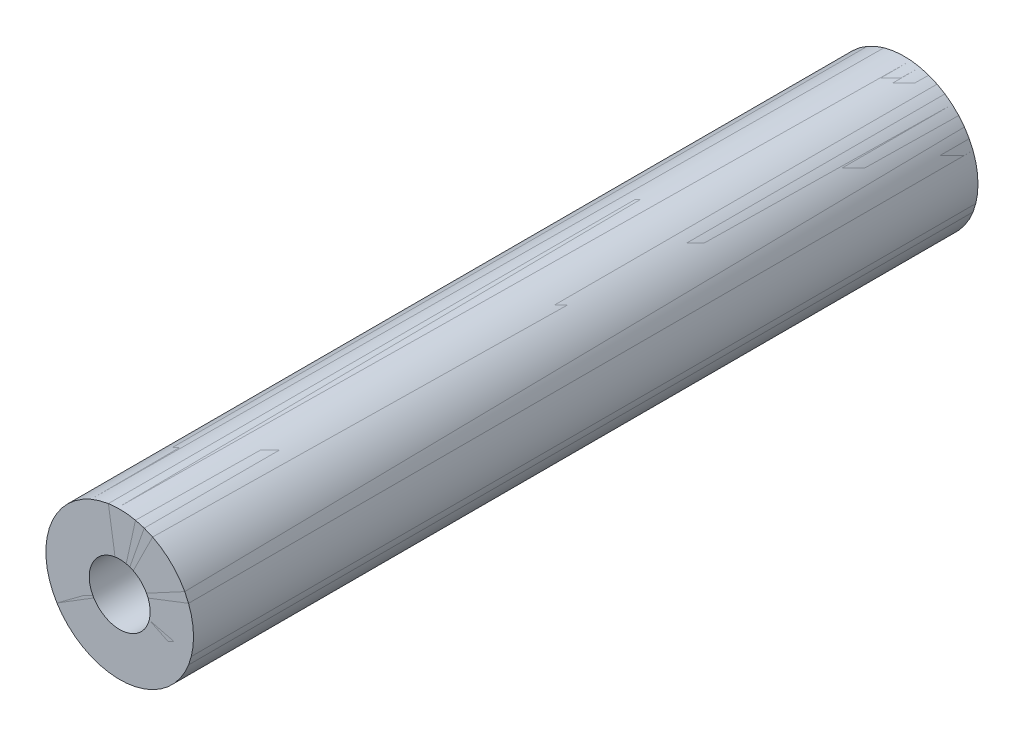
ISO-10303-21;
HEADER;
FILE_DESCRIPTION(('STEP AP214'),'2;1');
FILE_NAME('part.step','',(''),(''),'','','');
FILE_SCHEMA(('AUTOMOTIVE_DESIGN { 1 0 10303 214 1 1 1 1 }'));
ENDSEC;
DATA;
#1=APPLICATION_CONTEXT('core data for automotive mechanical design processes');
#2=APPLICATION_PROTOCOL_DEFINITION('international standard','automotive_design',2000,#1);
#3=PRODUCT_CONTEXT('',#1,'mechanical');
#4=PRODUCT('Part','Part','',(#3));
#5=PRODUCT_RELATED_PRODUCT_CATEGORY('part','',(#4));
#6=PRODUCT_DEFINITION_FORMATION('','',#4);
#7=PRODUCT_DEFINITION_CONTEXT('part definition',#1,'design');
#8=PRODUCT_DEFINITION('design','',#6,#7);
#9=PRODUCT_DEFINITION_SHAPE('','',#8);
#10=(LENGTH_UNIT() NAMED_UNIT(*) SI_UNIT(.MILLI.,.METRE.));
#11=(NAMED_UNIT(*) PLANE_ANGLE_UNIT() SI_UNIT($,.RADIAN.));
#12=(NAMED_UNIT(*) SI_UNIT($,.STERADIAN.) SOLID_ANGLE_UNIT());
#13=UNCERTAINTY_MEASURE_WITH_UNIT(LENGTH_MEASURE(1.E-05),#10,'distance_accuracy_value','');
#14=(GEOMETRIC_REPRESENTATION_CONTEXT(3) GLOBAL_UNCERTAINTY_ASSIGNED_CONTEXT((#13)) GLOBAL_UNIT_ASSIGNED_CONTEXT((#10,
#11,#12)) REPRESENTATION_CONTEXT('',''));
#15=CARTESIAN_POINT('',(0.,0.,0.));
#16=DIRECTION('',(0.,0.,1.));
#17=DIRECTION('',(1.,0.,0.));
#18=AXIS2_PLACEMENT_3D('',#15,#16,#17);
#19=CARTESIAN_POINT('',(-7.01417699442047,-0.607926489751,-55.));
#20=DIRECTION('',(0.,0.,1.));
#21=DIRECTION('',(-1.,0.,0.));
#22=AXIS2_PLACEMENT_3D('',#19,#20,#21);
#23=PLANE('',#22);
#24=CARTESIAN_POINT('',(-11.406250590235,-5.0000000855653,-55.));
#25=DIRECTION('',(0.,0.,1.));
#26=DIRECTION('',(1.,0.,0.));
#27=AXIS2_PLACEMENT_3D('',#24,#25,#26);
#28=CIRCLE('',#27,3.30000000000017);
#29=CARTESIAN_POINT('',(-8.10625059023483,-5.0000000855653,-55.));
#30=VERTEX_POINT('',#29);
#31=EDGE_CURVE('P0_E350',#30,#30,#28,.T.);
#32=ORIENTED_EDGE('',*,*,#31,.F.);
#33=EDGE_LOOP('',(#32));
#34=FACE_BOUND('',#33,.T.);
#35=ADVANCED_FACE('P0_F346',(#34),#23,.F.);
#36=CARTESIAN_POINT('',(-11.406250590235,-5.0000000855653,-85.));
#37=DIRECTION('',(0.,0.,1.));
#38=DIRECTION('',(1.,0.,0.));
#39=AXIS2_PLACEMENT_3D('',#36,#37,#38);
#40=CYLINDRICAL_SURFACE('',#39,3.30000000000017);
#41=ORIENTED_EDGE('',*,*,#31,.T.);
#42=EDGE_LOOP('',(#41));
#43=FACE_BOUND('',#42,.T.);
#44=CARTESIAN_POINT('',(-11.406250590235,-5.0000000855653,-85.));
#45=DIRECTION('',(0.,0.,1.));
#46=DIRECTION('',(1.,0.,0.));
#47=AXIS2_PLACEMENT_3D('',#44,#45,#46);
#48=CIRCLE('',#47,3.30000000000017);
#49=CARTESIAN_POINT('',(-8.10625059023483,-5.0000000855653,-85.));
#50=VERTEX_POINT('',#49);
#51=EDGE_CURVE('P0_E366',#50,#50,#48,.T.);
#52=ORIENTED_EDGE('',*,*,#51,.F.);
#53=EDGE_LOOP('',(#52));
#54=FACE_BOUND('',#53,.T.);
#55=ADVANCED_FACE('P0_F373',(#43,#54),#40,.F.);
#56=CARTESIAN_POINT('',(-21.8430920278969,5.43684135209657,-85.));
#57=DIRECTION('',(0.,0.,-1.));
#58=DIRECTION('',(1.,0.,0.));
#59=AXIS2_PLACEMENT_3D('',#56,#57,#58);
#60=PLANE('',#59);
#61=ORIENTED_EDGE('',*,*,#51,.T.);
#62=EDGE_LOOP('',(#61));
#63=FACE_BOUND('',#62,.T.);
#64=CARTESIAN_POINT('',(-11.406250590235,-5.0000000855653,-85.));
#65=DIRECTION('',(0.,0.,1.));
#66=DIRECTION('',(1.,0.,0.));
#67=AXIS2_PLACEMENT_3D('',#64,#65,#66);
#68=CIRCLE('',#67,8.0000000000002);
#69=CARTESIAN_POINT('',(-3.4062505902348,-5.0000000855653,-85.));
#70=VERTEX_POINT('',#69);
#71=EDGE_CURVE('P0_E364',#70,#70,#68,.F.);
#72=ORIENTED_EDGE('',*,*,#71,.T.);
#73=EDGE_LOOP('',(#72));
#74=FACE_BOUND('',#73,.T.);
#75=ADVANCED_FACE('P0_F381',(#63,#74),#60,.T.);
#76=CARTESIAN_POINT('',(-7.01417699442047,-9.3920736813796,-30.));
#77=DIRECTION('',(0.,0.,-1.));
#78=DIRECTION('',(-1.,0.,0.));
#79=AXIS2_PLACEMENT_3D('',#76,#77,#78);
#80=PLANE('',#79);
#81=CARTESIAN_POINT('',(-11.406250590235,-5.0000000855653,-30.));
#82=DIRECTION('',(0.,0.,1.));
#83=DIRECTION('',(1.,0.,0.));
#84=AXIS2_PLACEMENT_3D('',#81,#82,#83);
#85=CIRCLE('',#84,3.30000000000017);
#86=CARTESIAN_POINT('',(-8.10625059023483,-5.0000000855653,-30.));
#87=VERTEX_POINT('',#86);
#88=EDGE_CURVE('P0_E359',#87,#87,#85,.F.);
#89=ORIENTED_EDGE('',*,*,#88,.F.);
#90=EDGE_LOOP('',(#89));
#91=FACE_BOUND('',#90,.T.);
#92=ADVANCED_FACE('P0_F396',(#91),#80,.F.);
#93=CARTESIAN_POINT('',(-11.406250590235,-5.0000000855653,-85.));
#94=DIRECTION('',(0.,0.,1.));
#95=DIRECTION('',(1.,0.,0.));
#96=AXIS2_PLACEMENT_3D('',#93,#94,#95);
#97=CYLINDRICAL_SURFACE('',#96,8.0000000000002);
#98=ORIENTED_EDGE('',*,*,#71,.F.);
#99=EDGE_LOOP('',(#98));
#100=FACE_BOUND('',#99,.T.);
#101=CARTESIAN_POINT('',(-11.406250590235,-5.0000000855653,0.));
#102=DIRECTION('',(0.,0.,1.));
#103=DIRECTION('',(1.,0.,0.));
#104=AXIS2_PLACEMENT_3D('',#101,#102,#103);
#105=CIRCLE('',#104,8.0000000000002);
#106=CARTESIAN_POINT('',(-3.4062505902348,-5.0000000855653,0.));
#107=VERTEX_POINT('',#106);
#108=EDGE_CURVE('P0_E354',#107,#107,#105,.T.);
#109=ORIENTED_EDGE('',*,*,#108,.F.);
#110=EDGE_LOOP('',(#109));
#111=FACE_BOUND('',#110,.T.);
#112=ADVANCED_FACE('P0_F390',(#100,#111),#97,.T.);
#113=CARTESIAN_POINT('',(-11.406250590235,-5.0000000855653,-30.));
#114=DIRECTION('',(0.,0.,1.));
#115=DIRECTION('',(1.,0.,0.));
#116=AXIS2_PLACEMENT_3D('',#113,#114,#115);
#117=CYLINDRICAL_SURFACE('',#116,3.30000000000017);
#118=ORIENTED_EDGE('',*,*,#88,.T.);
#119=EDGE_LOOP('',(#118));
#120=FACE_BOUND('',#119,.T.);
#121=CARTESIAN_POINT('',(-11.406250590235,-5.00000008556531,0.));
#122=DIRECTION('',(0.,0.,1.));
#123=DIRECTION('',(1.,0.,0.));
#124=AXIS2_PLACEMENT_3D('',#121,#122,#123);
#125=CIRCLE('',#124,3.30000000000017);
#126=CARTESIAN_POINT('',(-8.10625059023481,-5.00000008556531,0.));
#127=VERTEX_POINT('',#126);
#128=EDGE_CURVE('P0_E10',#127,#127,#125,.F.);
#129=ORIENTED_EDGE('',*,*,#128,.F.);
#130=EDGE_LOOP('',(#129));
#131=FACE_BOUND('',#130,.T.);
#132=ADVANCED_FACE('P0_F386',(#120,#131),#117,.F.);
#133=CARTESIAN_POINT('',(-21.8430920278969,-15.4368415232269,0.));
#134=DIRECTION('',(0.,0.,1.));
#135=DIRECTION('',(1.,0.,0.));
#136=AXIS2_PLACEMENT_3D('',#133,#134,#135);
#137=PLANE('',#136);
#138=ORIENTED_EDGE('',*,*,#128,.T.);
#139=EDGE_LOOP('',(#138));
#140=FACE_BOUND('',#139,.T.);
#141=ORIENTED_EDGE('',*,*,#108,.T.);
#142=EDGE_LOOP('',(#141));
#143=FACE_BOUND('',#142,.T.);
#144=ADVANCED_FACE('P0_F348',(#140,#143),#137,.T.);
#145=CLOSED_SHELL('',(#35,#55,#75,#92,#112,#132,#144));
#146=MANIFOLD_SOLID_BREP('P0_B2',#145);
#147=CARTESIAN_POINT('',(-7.01417699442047,-0.607926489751,-55.));
#148=DIRECTION('',(0.,0.,1.));
#149=DIRECTION('',(-1.,0.,0.));
#150=AXIS2_PLACEMENT_3D('',#147,#148,#149);
#151=PLANE('',#150);
#152=CARTESIAN_POINT('',(-11.406250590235,-5.0000000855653,-55.));
#153=DIRECTION('',(0.,0.,1.));
#154=DIRECTION('',(1.,0.,0.));
#155=AXIS2_PLACEMENT_3D('',#152,#153,#154);
#156=CIRCLE('',#155,3.30000000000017);
#157=CARTESIAN_POINT('',(-8.10625059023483,-5.0000000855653,-55.));
#158=VERTEX_POINT('',#157);
#159=EDGE_CURVE('P1_E17',#158,#158,#156,.T.);
#160=ORIENTED_EDGE('',*,*,#159,.F.);
#161=EDGE_LOOP('',(#160));
#162=FACE_BOUND('',#161,.T.);
#163=ADVANCED_FACE('P1_F13',(#162),#151,.F.);
#164=CARTESIAN_POINT('',(-11.406250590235,-5.0000000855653,-85.));
#165=DIRECTION('',(0.,0.,1.));
#166=DIRECTION('',(1.,0.,0.));
#167=AXIS2_PLACEMENT_3D('',#164,#165,#166);
#168=CYLINDRICAL_SURFACE('',#167,3.30000000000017);
#169=ORIENTED_EDGE('',*,*,#159,.T.);
#170=EDGE_LOOP('',(#169));
#171=FACE_BOUND('',#170,.T.);
#172=CARTESIAN_POINT('',(-11.406250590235,-5.0000000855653,-85.));
#173=DIRECTION('',(0.,0.,1.));
#174=DIRECTION('',(1.,0.,0.));
#175=AXIS2_PLACEMENT_3D('',#172,#173,#174);
#176=CIRCLE('',#175,3.30000000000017);
#177=CARTESIAN_POINT('',(-8.10625059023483,-5.0000000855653,-85.));
#178=VERTEX_POINT('',#177);
#179=EDGE_CURVE('P1_E33',#178,#178,#176,.T.);
#180=ORIENTED_EDGE('',*,*,#179,.F.);
#181=EDGE_LOOP('',(#180));
#182=FACE_BOUND('',#181,.T.);
#183=ADVANCED_FACE('P1_F40',(#171,#182),#168,.F.);
#184=CARTESIAN_POINT('',(-21.8430920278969,5.43684135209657,-85.));
#185=DIRECTION('',(0.,0.,-1.));
#186=DIRECTION('',(1.,0.,0.));
#187=AXIS2_PLACEMENT_3D('',#184,#185,#186);
#188=PLANE('',#187);
#189=ORIENTED_EDGE('',*,*,#179,.T.);
#190=EDGE_LOOP('',(#189));
#191=FACE_BOUND('',#190,.T.);
#192=CARTESIAN_POINT('',(-11.406250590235,-5.0000000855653,-85.));
#193=DIRECTION('',(0.,0.,1.));
#194=DIRECTION('',(1.,0.,0.));
#195=AXIS2_PLACEMENT_3D('',#192,#193,#194);
#196=CIRCLE('',#195,8.0000000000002);
#197=CARTESIAN_POINT('',(-3.4062505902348,-5.0000000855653,-85.));
#198=VERTEX_POINT('',#197);
#199=EDGE_CURVE('P1_E31',#198,#198,#196,.F.);
#200=ORIENTED_EDGE('',*,*,#199,.T.);
#201=EDGE_LOOP('',(#200));
#202=FACE_BOUND('',#201,.T.);
#203=ADVANCED_FACE('P1_F48',(#191,#202),#188,.T.);
#204=CARTESIAN_POINT('',(-7.01417699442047,-9.3920736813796,-30.));
#205=DIRECTION('',(0.,0.,-1.));
#206=DIRECTION('',(-1.,0.,0.));
#207=AXIS2_PLACEMENT_3D('',#204,#205,#206);
#208=PLANE('',#207);
#209=CARTESIAN_POINT('',(-11.406250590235,-5.0000000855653,-30.));
#210=DIRECTION('',(0.,0.,1.));
#211=DIRECTION('',(1.,0.,0.));
#212=AXIS2_PLACEMENT_3D('',#209,#210,#211);
#213=CIRCLE('',#212,3.30000000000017);
#214=CARTESIAN_POINT('',(-8.10625059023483,-5.0000000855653,-30.));
#215=VERTEX_POINT('',#214);
#216=EDGE_CURVE('P1_E26',#215,#215,#213,.F.);
#217=ORIENTED_EDGE('',*,*,#216,.F.);
#218=EDGE_LOOP('',(#217));
#219=FACE_BOUND('',#218,.T.);
#220=ADVANCED_FACE('P1_F62',(#219),#208,.F.);
#221=CARTESIAN_POINT('',(-11.406250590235,-5.0000000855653,-85.));
#222=DIRECTION('',(0.,0.,1.));
#223=DIRECTION('',(1.,0.,0.));
#224=AXIS2_PLACEMENT_3D('',#221,#222,#223);
#225=CYLINDRICAL_SURFACE('',#224,8.0000000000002);
#226=ORIENTED_EDGE('',*,*,#199,.F.);
#227=EDGE_LOOP('',(#226));
#228=FACE_BOUND('',#227,.T.);
#229=CARTESIAN_POINT('',(-11.406250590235,-5.0000000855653,0.));
#230=DIRECTION('',(0.,0.,1.));
#231=DIRECTION('',(1.,0.,0.));
#232=AXIS2_PLACEMENT_3D('',#229,#230,#231);
#233=CIRCLE('',#232,8.0000000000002);
#234=CARTESIAN_POINT('',(-3.4062505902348,-5.0000000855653,0.));
#235=VERTEX_POINT('',#234);
#236=EDGE_CURVE('P1_E21',#235,#235,#233,.T.);
#237=ORIENTED_EDGE('',*,*,#236,.F.);
#238=EDGE_LOOP('',(#237));
#239=FACE_BOUND('',#238,.T.);
#240=ADVANCED_FACE('P1_F56',(#228,#239),#225,.T.);
#241=CARTESIAN_POINT('',(-11.406250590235,-5.0000000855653,-30.));
#242=DIRECTION('',(0.,0.,1.));
#243=DIRECTION('',(1.,0.,0.));
#244=AXIS2_PLACEMENT_3D('',#241,#242,#243);
#245=CYLINDRICAL_SURFACE('',#244,3.30000000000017);
#246=ORIENTED_EDGE('',*,*,#216,.T.);
#247=EDGE_LOOP('',(#246));
#248=FACE_BOUND('',#247,.T.);
#249=CARTESIAN_POINT('',(-11.406250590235,-5.00000008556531,0.));
#250=DIRECTION('',(0.,0.,1.));
#251=DIRECTION('',(1.,0.,0.));
#252=AXIS2_PLACEMENT_3D('',#249,#250,#251);
#253=CIRCLE('',#252,3.30000000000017);
#254=CARTESIAN_POINT('',(-8.10625059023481,-5.00000008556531,0.));
#255=VERTEX_POINT('',#254);
#256=EDGE_CURVE('P1_E9',#255,#255,#253,.F.);
#257=ORIENTED_EDGE('',*,*,#256,.F.);
#258=EDGE_LOOP('',(#257));
#259=FACE_BOUND('',#258,.T.);
#260=ADVANCED_FACE('P1_F53',(#248,#259),#245,.F.);
#261=CARTESIAN_POINT('',(-21.8430920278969,-15.4368415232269,0.));
#262=DIRECTION('',(0.,0.,1.));
#263=DIRECTION('',(1.,0.,0.));
#264=AXIS2_PLACEMENT_3D('',#261,#262,#263);
#265=PLANE('',#264);
#266=ORIENTED_EDGE('',*,*,#256,.T.);
#267=EDGE_LOOP('',(#266));
#268=FACE_BOUND('',#267,.T.);
#269=ORIENTED_EDGE('',*,*,#236,.T.);
#270=EDGE_LOOP('',(#269));
#271=FACE_BOUND('',#270,.T.);
#272=ADVANCED_FACE('P1_F15',(#268,#271),#265,.T.);
#273=CLOSED_SHELL('',(#163,#183,#203,#220,#240,#260,#272));
#274=MANIFOLD_SOLID_BREP('P1_B1',#273);
#275=ADVANCED_BREP_SHAPE_REPRESENTATION('',(#18,#146,#274),#14);
#276=SHAPE_DEFINITION_REPRESENTATION(#9,#275);
ENDSEC;
END-ISO-10303-21;
